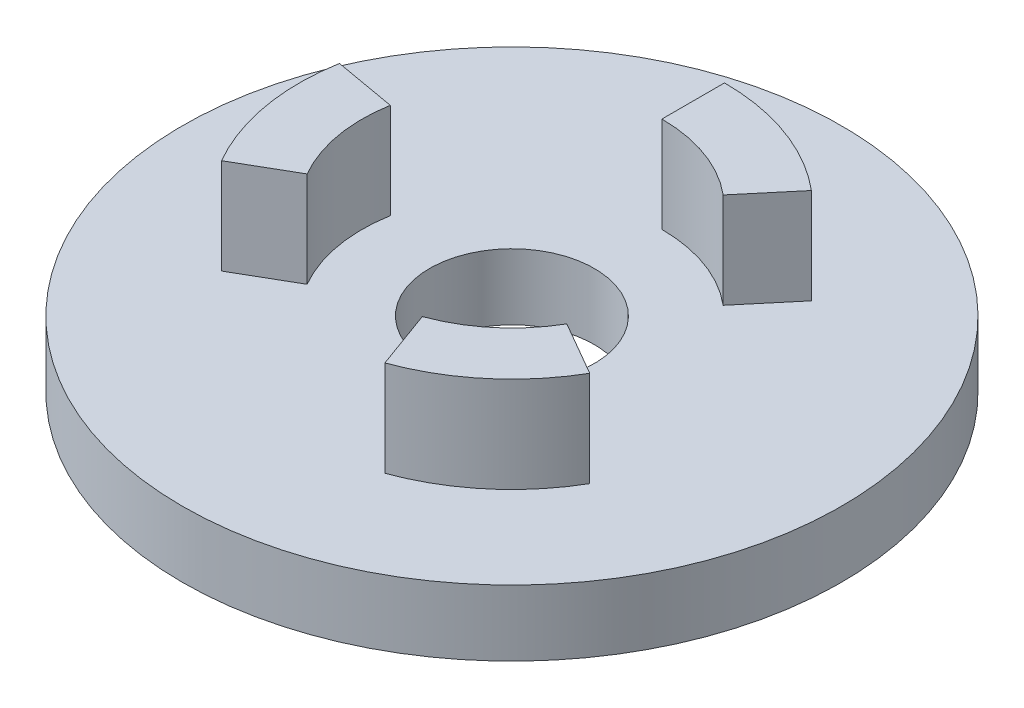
ISO-10303-21;
HEADER;
FILE_DESCRIPTION(('STEP AP214'),'2;1');
FILE_NAME('part.step','',(''),(''),'','','');
FILE_SCHEMA(('AUTOMOTIVE_DESIGN { 1 0 10303 214 1 1 1 1 }'));
ENDSEC;
DATA;
#1=APPLICATION_CONTEXT('core data for automotive mechanical design processes');
#2=APPLICATION_PROTOCOL_DEFINITION('international standard','automotive_design',2000,#1);
#3=PRODUCT_CONTEXT('',#1,'mechanical');
#4=PRODUCT('Part','Part','',(#3));
#5=PRODUCT_RELATED_PRODUCT_CATEGORY('part','',(#4));
#6=PRODUCT_DEFINITION_FORMATION('','',#4);
#7=PRODUCT_DEFINITION_CONTEXT('part definition',#1,'design');
#8=PRODUCT_DEFINITION('design','',#6,#7);
#9=PRODUCT_DEFINITION_SHAPE('','',#8);
#10=(LENGTH_UNIT() NAMED_UNIT(*) SI_UNIT(.MILLI.,.METRE.));
#11=(NAMED_UNIT(*) PLANE_ANGLE_UNIT() SI_UNIT($,.RADIAN.));
#12=(NAMED_UNIT(*) SI_UNIT($,.STERADIAN.) SOLID_ANGLE_UNIT());
#13=UNCERTAINTY_MEASURE_WITH_UNIT(LENGTH_MEASURE(1.E-05),#10,'distance_accuracy_value','');
#14=(GEOMETRIC_REPRESENTATION_CONTEXT(3) GLOBAL_UNCERTAINTY_ASSIGNED_CONTEXT((#13)) GLOBAL_UNIT_ASSIGNED_CONTEXT((#10,
#11,#12)) REPRESENTATION_CONTEXT('',''));
#15=CARTESIAN_POINT('',(0.,0.,0.));
#16=DIRECTION('',(0.,0.,1.));
#17=DIRECTION('',(1.,0.,0.));
#18=AXIS2_PLACEMENT_3D('',#15,#16,#17);
#19=CARTESIAN_POINT('',(0.,2.,0.));
#20=DIRECTION('',(0.,1.,0.));
#21=DIRECTION('',(0.,0.,1.));
#22=AXIS2_PLACEMENT_3D('',#19,#20,#21);
#23=PLANE('',#22);
#24=CARTESIAN_POINT('',(0.,2.,0.));
#25=DIRECTION('',(0.,1.,0.));
#26=DIRECTION('',(0.,0.,1.));
#27=AXIS2_PLACEMENT_3D('',#24,#25,#26);
#28=CIRCLE('',#27,2.5);
#29=CARTESIAN_POINT('',(0.,2.,2.5));
#30=VERTEX_POINT('',#29);
#31=EDGE_CURVE('E302',#30,#30,#28,.T.);
#32=ORIENTED_EDGE('',*,*,#31,.F.);
#33=EDGE_LOOP('',(#32));
#34=FACE_BOUND('',#33,.T.);
#35=CARTESIAN_POINT('',(0.,2.,0.));
#36=DIRECTION('',(0.,1.,0.));
#37=DIRECTION('',(0.866025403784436,0.,-0.500000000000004));
#38=AXIS2_PLACEMENT_3D('',#35,#36,#37);
#39=CIRCLE('',#38,6.45);
#40=CARTESIAN_POINT('',(-6.35201000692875,2.,-1.12003074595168));
#41=VERTEX_POINT('',#40);
#42=CARTESIAN_POINT('',(-5.58586385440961,2.,3.22500000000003));
#43=VERTEX_POINT('',#42);
#44=EDGE_CURVE('E151',#41,#43,#39,.T.);
#45=ORIENTED_EDGE('',*,*,#44,.F.);
#46=DIRECTION('',(-0.984807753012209,0.,-0.173648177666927));
#47=VECTOR('',#46,1.);
#48=CARTESIAN_POINT('',(0.,2.,0.));
#49=LINE('',#48,#47);
#50=CARTESIAN_POINT('',(-4.48087527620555,2.,-0.790099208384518));
#51=VERTEX_POINT('',#50);
#52=EDGE_CURVE('E148',#51,#41,#49,.T.);
#53=ORIENTED_EDGE('',*,*,#52,.F.);
#54=CARTESIAN_POINT('',(0.,2.,0.));
#55=DIRECTION('',(0.,1.,0.));
#56=DIRECTION('',(0.866025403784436,0.,-0.500000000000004));
#57=AXIS2_PLACEMENT_3D('',#54,#55,#56);
#58=CIRCLE('',#57,4.55);
#59=CARTESIAN_POINT('',(-3.94041558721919,2.,2.27500000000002));
#60=VERTEX_POINT('',#59);
#61=EDGE_CURVE('E161',#51,#60,#58,.T.);
#62=ORIENTED_EDGE('',*,*,#61,.T.);
#63=DIRECTION('',(-0.866025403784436,0.,0.500000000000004));
#64=VECTOR('',#63,1.);
#65=CARTESIAN_POINT('',(0.,2.,0.));
#66=LINE('',#65,#64);
#67=EDGE_CURVE('E172',#60,#43,#66,.T.);
#68=ORIENTED_EDGE('',*,*,#67,.T.);
#69=EDGE_LOOP('',(#45,#53,#62,#68));
#70=FACE_BOUND('',#69,.T.);
#71=CARTESIAN_POINT('',(0.,2.,0.));
#72=DIRECTION('',(0.,1.,0.));
#73=DIRECTION('',(0.,0.,1.));
#74=AXIS2_PLACEMENT_3D('',#71,#72,#73);
#75=CIRCLE('',#74,10.);
#76=CARTESIAN_POINT('',(0.,2.,10.));
#77=VERTEX_POINT('',#76);
#78=EDGE_CURVE('E11',#77,#77,#75,.T.);
#79=ORIENTED_EDGE('',*,*,#78,.T.);
#80=EDGE_LOOP('',(#79));
#81=FACE_BOUND('',#80,.T.);
#82=CARTESIAN_POINT('',(0.,2.,0.));
#83=DIRECTION('',(0.,1.,0.));
#84=DIRECTION('',(0.,0.,1.));
#85=AXIS2_PLACEMENT_3D('',#82,#83,#84);
#86=CIRCLE('',#85,6.45);
#87=CARTESIAN_POINT('',(4.14598008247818,2.,-4.9409866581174));
#88=VERTEX_POINT('',#87);
#89=CARTESIAN_POINT('',(0.,2.,-6.45));
#90=VERTEX_POINT('',#89);
#91=EDGE_CURVE('E202',#88,#90,#86,.T.);
#92=ORIENTED_EDGE('',*,*,#91,.F.);
#93=DIRECTION('',(0.642787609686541,0.,-0.766044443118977));
#94=VECTOR('',#93,1.);
#95=CARTESIAN_POINT('',(0.,2.,0.));
#96=LINE('',#95,#94);
#97=CARTESIAN_POINT('',(2.92468362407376,2.,-3.48550221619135));
#98=VERTEX_POINT('',#97);
#99=EDGE_CURVE('E186',#98,#88,#96,.T.);
#100=ORIENTED_EDGE('',*,*,#99,.F.);
#101=CARTESIAN_POINT('',(0.,2.,0.));
#102=DIRECTION('',(0.,1.,0.));
#103=DIRECTION('',(0.,0.,1.));
#104=AXIS2_PLACEMENT_3D('',#101,#102,#103);
#105=CIRCLE('',#104,4.55);
#106=CARTESIAN_POINT('',(0.,2.,-4.55));
#107=VERTEX_POINT('',#106);
#108=EDGE_CURVE('E191',#98,#107,#105,.T.);
#109=ORIENTED_EDGE('',*,*,#108,.T.);
#110=DIRECTION('',(0.,0.,-1.));
#111=VECTOR('',#110,1.);
#112=CARTESIAN_POINT('',(0.,2.,0.));
#113=LINE('',#112,#111);
#114=EDGE_CURVE('E205',#107,#90,#113,.T.);
#115=ORIENTED_EDGE('',*,*,#114,.T.);
#116=EDGE_LOOP('',(#92,#100,#109,#115));
#117=FACE_BOUND('',#116,.T.);
#118=CARTESIAN_POINT('',(0.,2.,0.));
#119=DIRECTION('',(0.,1.,0.));
#120=DIRECTION('',(-0.866025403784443,0.,-0.499999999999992));
#121=AXIS2_PLACEMENT_3D('',#118,#119,#120);
#122=CIRCLE('',#121,6.45);
#123=CARTESIAN_POINT('',(2.20602992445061,2.,6.06101740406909));
#124=VERTEX_POINT('',#123);
#125=CARTESIAN_POINT('',(5.58586385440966,2.,3.22499999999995));
#126=VERTEX_POINT('',#125);
#127=EDGE_CURVE('E52',#124,#126,#122,.T.);
#128=ORIENTED_EDGE('',*,*,#127,.F.);
#129=DIRECTION('',(0.342020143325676,0.,0.939692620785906));
#130=VECTOR('',#129,1.);
#131=CARTESIAN_POINT('',(0.,2.,0.));
#132=LINE('',#131,#130);
#133=CARTESIAN_POINT('',(1.55619165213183,2.,4.27560142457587));
#134=VERTEX_POINT('',#133);
#135=EDGE_CURVE('E147',#134,#124,#132,.T.);
#136=ORIENTED_EDGE('',*,*,#135,.F.);
#137=CARTESIAN_POINT('',(0.,2.,0.));
#138=DIRECTION('',(0.,1.,0.));
#139=DIRECTION('',(-0.866025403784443,0.,-0.499999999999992));
#140=AXIS2_PLACEMENT_3D('',#137,#138,#139);
#141=CIRCLE('',#140,4.55);
#142=CARTESIAN_POINT('',(3.94041558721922,2.,2.27499999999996));
#143=VERTEX_POINT('',#142);
#144=EDGE_CURVE('E144',#134,#143,#141,.T.);
#145=ORIENTED_EDGE('',*,*,#144,.T.);
#146=DIRECTION('',(0.866025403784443,0.,0.499999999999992));
#147=VECTOR('',#146,1.);
#148=CARTESIAN_POINT('',(0.,2.,0.));
#149=LINE('',#148,#147);
#150=EDGE_CURVE('E57',#143,#126,#149,.T.);
#151=ORIENTED_EDGE('',*,*,#150,.T.);
#152=EDGE_LOOP('',(#128,#136,#145,#151));
#153=FACE_BOUND('',#152,.T.);
#154=ADVANCED_FACE('F37',(#34,#70,#81,#117,#153),#23,.T.);
#155=CARTESIAN_POINT('',(0.,2.,0.));
#156=DIRECTION('',(0.,-1.,0.));
#157=DIRECTION('',(0.,0.,-1.));
#158=AXIS2_PLACEMENT_3D('',#155,#156,#157);
#159=CYLINDRICAL_SURFACE('',#158,10.);
#160=ORIENTED_EDGE('',*,*,#78,.F.);
#161=EDGE_LOOP('',(#160));
#162=FACE_BOUND('',#161,.T.);
#163=CARTESIAN_POINT('',(0.,0.,0.));
#164=DIRECTION('',(0.,1.,0.));
#165=DIRECTION('',(0.,0.,1.));
#166=AXIS2_PLACEMENT_3D('',#163,#164,#165);
#167=CIRCLE('',#166,10.);
#168=CARTESIAN_POINT('',(0.,0.,10.));
#169=VERTEX_POINT('',#168);
#170=EDGE_CURVE('E41',#169,#169,#167,.T.);
#171=ORIENTED_EDGE('',*,*,#170,.T.);
#172=EDGE_LOOP('',(#171));
#173=FACE_BOUND('',#172,.T.);
#174=ADVANCED_FACE('F39',(#162,#173),#159,.T.);
#175=CARTESIAN_POINT('',(0.,0.,0.));
#176=DIRECTION('',(0.,1.,0.));
#177=DIRECTION('',(0.,0.,1.));
#178=AXIS2_PLACEMENT_3D('',#175,#176,#177);
#179=PLANE('',#178);
#180=CARTESIAN_POINT('',(0.,0.,0.));
#181=DIRECTION('',(0.,1.,0.));
#182=DIRECTION('',(0.,0.,1.));
#183=AXIS2_PLACEMENT_3D('',#180,#181,#182);
#184=CIRCLE('',#183,2.5);
#185=CARTESIAN_POINT('',(0.,0.,2.5));
#186=VERTEX_POINT('',#185);
#187=EDGE_CURVE('E300',#186,#186,#184,.T.);
#188=ORIENTED_EDGE('',*,*,#187,.T.);
#189=EDGE_LOOP('',(#188));
#190=FACE_BOUND('',#189,.T.);
#191=ORIENTED_EDGE('',*,*,#170,.F.);
#192=EDGE_LOOP('',(#191));
#193=FACE_BOUND('',#192,.T.);
#194=ADVANCED_FACE('F224',(#190,#193),#179,.F.);
#195=CARTESIAN_POINT('',(0.,4.9,0.));
#196=DIRECTION('',(-0.766044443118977,0.,-0.64278760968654));
#197=DIRECTION('',(-0.642787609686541,0.,0.766044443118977));
#198=AXIS2_PLACEMENT_3D('',#195,#196,#197);
#199=PLANE('',#198);
#200=ORIENTED_EDGE('',*,*,#99,.T.);
#201=DIRECTION('',(0.,-1.,0.));
#202=VECTOR('',#201,1.);
#203=CARTESIAN_POINT('',(4.14598008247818,4.9,-4.9409866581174));
#204=LINE('',#203,#202);
#205=CARTESIAN_POINT('',(4.14598008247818,4.9,-4.9409866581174));
#206=VERTEX_POINT('',#205);
#207=EDGE_CURVE('E216',#206,#88,#204,.T.);
#208=ORIENTED_EDGE('',*,*,#207,.F.);
#209=DIRECTION('',(0.642787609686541,0.,-0.766044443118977));
#210=VECTOR('',#209,1.);
#211=CARTESIAN_POINT('',(0.,4.9,0.));
#212=LINE('',#211,#210);
#213=CARTESIAN_POINT('',(2.92468362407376,4.9,-3.48550221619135));
#214=VERTEX_POINT('',#213);
#215=EDGE_CURVE('E187',#214,#206,#212,.T.);
#216=ORIENTED_EDGE('',*,*,#215,.F.);
#217=DIRECTION('',(0.,-1.,0.));
#218=VECTOR('',#217,1.);
#219=CARTESIAN_POINT('',(2.92468362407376,4.9,-3.48550221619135));
#220=LINE('',#219,#218);
#221=EDGE_CURVE('E199',#214,#98,#220,.T.);
#222=ORIENTED_EDGE('',*,*,#221,.T.);
#223=EDGE_LOOP('',(#200,#208,#216,#222));
#224=FACE_BOUND('',#223,.T.);
#225=ADVANCED_FACE('F226',(#224),#199,.F.);
#226=CARTESIAN_POINT('',(0.,4.9,0.));
#227=DIRECTION('',(0.,-1.,0.));
#228=DIRECTION('',(0.,0.,-1.));
#229=AXIS2_PLACEMENT_3D('',#226,#227,#228);
#230=CYLINDRICAL_SURFACE('',#229,6.45);
#231=ORIENTED_EDGE('',*,*,#91,.T.);
#232=DIRECTION('',(0.,-1.,0.));
#233=VECTOR('',#232,1.);
#234=CARTESIAN_POINT('',(0.,4.9,-6.45));
#235=LINE('',#234,#233);
#236=CARTESIAN_POINT('',(0.,4.9,-6.45));
#237=VERTEX_POINT('',#236);
#238=EDGE_CURVE('E213',#237,#90,#235,.T.);
#239=ORIENTED_EDGE('',*,*,#238,.F.);
#240=CARTESIAN_POINT('',(0.,4.9,0.));
#241=DIRECTION('',(0.,1.,0.));
#242=DIRECTION('',(0.,0.,1.));
#243=AXIS2_PLACEMENT_3D('',#240,#241,#242);
#244=CIRCLE('',#243,6.45);
#245=EDGE_CURVE('E190',#206,#237,#244,.T.);
#246=ORIENTED_EDGE('',*,*,#245,.F.);
#247=ORIENTED_EDGE('',*,*,#207,.T.);
#248=EDGE_LOOP('',(#231,#239,#246,#247));
#249=FACE_BOUND('',#248,.T.);
#250=ADVANCED_FACE('F232',(#249),#230,.T.);
#251=CARTESIAN_POINT('',(0.,4.9,0.));
#252=DIRECTION('',(-1.,0.,0.));
#253=DIRECTION('',(0.,0.,1.));
#254=AXIS2_PLACEMENT_3D('',#251,#252,#253);
#255=PLANE('',#254);
#256=ORIENTED_EDGE('',*,*,#114,.F.);
#257=DIRECTION('',(0.,-1.,0.));
#258=VECTOR('',#257,1.);
#259=CARTESIAN_POINT('',(0.,4.9,-4.55));
#260=LINE('',#259,#258);
#261=CARTESIAN_POINT('',(0.,4.9,-4.55));
#262=VERTEX_POINT('',#261);
#263=EDGE_CURVE('E210',#262,#107,#260,.T.);
#264=ORIENTED_EDGE('',*,*,#263,.F.);
#265=DIRECTION('',(0.,0.,-1.));
#266=VECTOR('',#265,1.);
#267=CARTESIAN_POINT('',(0.,4.9,0.));
#268=LINE('',#267,#266);
#269=EDGE_CURVE('E193',#262,#237,#268,.T.);
#270=ORIENTED_EDGE('',*,*,#269,.T.);
#271=ORIENTED_EDGE('',*,*,#238,.T.);
#272=EDGE_LOOP('',(#256,#264,#270,#271));
#273=FACE_BOUND('',#272,.T.);
#274=ADVANCED_FACE('F247',(#273),#255,.T.);
#275=CARTESIAN_POINT('',(0.,4.9,0.));
#276=DIRECTION('',(0.,-1.,0.));
#277=DIRECTION('',(0.,0.,-1.));
#278=AXIS2_PLACEMENT_3D('',#275,#276,#277);
#279=CYLINDRICAL_SURFACE('',#278,4.55);
#280=ORIENTED_EDGE('',*,*,#108,.F.);
#281=ORIENTED_EDGE('',*,*,#221,.F.);
#282=CARTESIAN_POINT('',(0.,4.9,0.));
#283=DIRECTION('',(0.,1.,0.));
#284=DIRECTION('',(0.,0.,1.));
#285=AXIS2_PLACEMENT_3D('',#282,#283,#284);
#286=CIRCLE('',#285,4.55);
#287=EDGE_CURVE('E196',#214,#262,#286,.T.);
#288=ORIENTED_EDGE('',*,*,#287,.T.);
#289=ORIENTED_EDGE('',*,*,#263,.T.);
#290=EDGE_LOOP('',(#280,#281,#288,#289));
#291=FACE_BOUND('',#290,.T.);
#292=ADVANCED_FACE('F250',(#291),#279,.F.);
#293=CARTESIAN_POINT('',(0.,4.9,0.));
#294=DIRECTION('',(0.,1.,0.));
#295=DIRECTION('',(0.,0.,1.));
#296=AXIS2_PLACEMENT_3D('',#293,#294,#295);
#297=PLANE('',#296);
#298=ORIENTED_EDGE('',*,*,#215,.T.);
#299=ORIENTED_EDGE('',*,*,#245,.T.);
#300=ORIENTED_EDGE('',*,*,#269,.F.);
#301=ORIENTED_EDGE('',*,*,#287,.F.);
#302=EDGE_LOOP('',(#298,#299,#300,#301));
#303=FACE_BOUND('',#302,.T.);
#304=ADVANCED_FACE('F254',(#303),#297,.T.);
#305=CARTESIAN_POINT('',(0.,4.9,0.));
#306=DIRECTION('',(-0.173648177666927,0.,0.984807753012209));
#307=DIRECTION('',(0.984807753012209,0.,0.173648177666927));
#308=AXIS2_PLACEMENT_3D('',#305,#306,#307);
#309=PLANE('',#308);
#310=ORIENTED_EDGE('',*,*,#52,.T.);
#311=DIRECTION('',(0.,-1.,0.));
#312=VECTOR('',#311,1.);
#313=CARTESIAN_POINT('',(-6.35201000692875,4.9,-1.12003074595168));
#314=LINE('',#313,#312);
#315=CARTESIAN_POINT('',(-6.35201000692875,4.9,-1.12003074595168));
#316=VERTEX_POINT('',#315);
#317=EDGE_CURVE('E183',#316,#41,#314,.T.);
#318=ORIENTED_EDGE('',*,*,#317,.F.);
#319=DIRECTION('',(-0.984807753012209,0.,-0.173648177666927));
#320=VECTOR('',#319,1.);
#321=CARTESIAN_POINT('',(0.,4.9,0.));
#322=LINE('',#321,#320);
#323=CARTESIAN_POINT('',(-4.48087527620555,4.9,-0.790099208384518));
#324=VERTEX_POINT('',#323);
#325=EDGE_CURVE('E157',#324,#316,#322,.T.);
#326=ORIENTED_EDGE('',*,*,#325,.F.);
#327=DIRECTION('',(0.,-1.,0.));
#328=VECTOR('',#327,1.);
#329=CARTESIAN_POINT('',(-4.48087527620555,4.9,-0.790099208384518));
#330=LINE('',#329,#328);
#331=EDGE_CURVE('E168',#324,#51,#330,.T.);
#332=ORIENTED_EDGE('',*,*,#331,.T.);
#333=EDGE_LOOP('',(#310,#318,#326,#332));
#334=FACE_BOUND('',#333,.T.);
#335=ADVANCED_FACE('F258',(#334),#309,.F.);
#336=CARTESIAN_POINT('',(0.,4.9,0.));
#337=DIRECTION('',(0.,-1.,0.));
#338=DIRECTION('',(0.,0.,-1.));
#339=AXIS2_PLACEMENT_3D('',#336,#337,#338);
#340=CYLINDRICAL_SURFACE('',#339,6.45);
#341=ORIENTED_EDGE('',*,*,#44,.T.);
#342=DIRECTION('',(0.,-1.,0.));
#343=VECTOR('',#342,1.);
#344=CARTESIAN_POINT('',(-5.58586385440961,4.9,3.22500000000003));
#345=LINE('',#344,#343);
#346=CARTESIAN_POINT('',(-5.58586385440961,4.9,3.22500000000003));
#347=VERTEX_POINT('',#346);
#348=EDGE_CURVE('E180',#347,#43,#345,.T.);
#349=ORIENTED_EDGE('',*,*,#348,.F.);
#350=CARTESIAN_POINT('',(0.,4.9,0.));
#351=DIRECTION('',(0.,1.,0.));
#352=DIRECTION('',(0.866025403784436,0.,-0.500000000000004));
#353=AXIS2_PLACEMENT_3D('',#350,#351,#352);
#354=CIRCLE('',#353,6.45);
#355=EDGE_CURVE('E160',#316,#347,#354,.T.);
#356=ORIENTED_EDGE('',*,*,#355,.F.);
#357=ORIENTED_EDGE('',*,*,#317,.T.);
#358=EDGE_LOOP('',(#341,#349,#356,#357));
#359=FACE_BOUND('',#358,.T.);
#360=ADVANCED_FACE('F262',(#359),#340,.T.);
#361=CARTESIAN_POINT('',(0.,4.9,0.));
#362=DIRECTION('',(0.500000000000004,0.,0.866025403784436));
#363=DIRECTION('',(0.866025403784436,0.,-0.500000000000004));
#364=AXIS2_PLACEMENT_3D('',#361,#362,#363);
#365=PLANE('',#364);
#366=ORIENTED_EDGE('',*,*,#67,.F.);
#367=DIRECTION('',(0.,-1.,0.));
#368=VECTOR('',#367,1.);
#369=CARTESIAN_POINT('',(-3.94041558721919,4.9,2.27500000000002));
#370=LINE('',#369,#368);
#371=CARTESIAN_POINT('',(-3.94041558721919,4.9,2.27500000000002));
#372=VERTEX_POINT('',#371);
#373=EDGE_CURVE('E177',#372,#60,#370,.T.);
#374=ORIENTED_EDGE('',*,*,#373,.F.);
#375=DIRECTION('',(-0.866025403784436,0.,0.500000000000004));
#376=VECTOR('',#375,1.);
#377=CARTESIAN_POINT('',(0.,4.9,0.));
#378=LINE('',#377,#376);
#379=EDGE_CURVE('E163',#372,#347,#378,.T.);
#380=ORIENTED_EDGE('',*,*,#379,.T.);
#381=ORIENTED_EDGE('',*,*,#348,.T.);
#382=EDGE_LOOP('',(#366,#374,#380,#381));
#383=FACE_BOUND('',#382,.T.);
#384=ADVANCED_FACE('F266',(#383),#365,.T.);
#385=CARTESIAN_POINT('',(0.,4.9,0.));
#386=DIRECTION('',(0.,-1.,0.));
#387=DIRECTION('',(0.,0.,-1.));
#388=AXIS2_PLACEMENT_3D('',#385,#386,#387);
#389=CYLINDRICAL_SURFACE('',#388,4.55);
#390=ORIENTED_EDGE('',*,*,#61,.F.);
#391=ORIENTED_EDGE('',*,*,#331,.F.);
#392=CARTESIAN_POINT('',(0.,4.9,0.));
#393=DIRECTION('',(0.,1.,0.));
#394=DIRECTION('',(0.866025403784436,0.,-0.500000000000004));
#395=AXIS2_PLACEMENT_3D('',#392,#393,#394);
#396=CIRCLE('',#395,4.55);
#397=EDGE_CURVE('E166',#324,#372,#396,.T.);
#398=ORIENTED_EDGE('',*,*,#397,.T.);
#399=ORIENTED_EDGE('',*,*,#373,.T.);
#400=EDGE_LOOP('',(#390,#391,#398,#399));
#401=FACE_BOUND('',#400,.T.);
#402=ADVANCED_FACE('F270',(#401),#389,.F.);
#403=CARTESIAN_POINT('',(0.,4.9,0.));
#404=DIRECTION('',(0.,1.,0.));
#405=DIRECTION('',(0.866025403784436,0.,-0.500000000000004));
#406=AXIS2_PLACEMENT_3D('',#403,#404,#405);
#407=PLANE('',#406);
#408=ORIENTED_EDGE('',*,*,#325,.T.);
#409=ORIENTED_EDGE('',*,*,#355,.T.);
#410=ORIENTED_EDGE('',*,*,#379,.F.);
#411=ORIENTED_EDGE('',*,*,#397,.F.);
#412=EDGE_LOOP('',(#408,#409,#410,#411));
#413=FACE_BOUND('',#412,.T.);
#414=ADVANCED_FACE('F274',(#413),#407,.T.);
#415=CARTESIAN_POINT('',(0.,4.9,0.));
#416=DIRECTION('',(0.939692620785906,0.,-0.342020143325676));
#417=DIRECTION('',(-0.342020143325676,0.,-0.939692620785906));
#418=AXIS2_PLACEMENT_3D('',#415,#416,#417);
#419=PLANE('',#418);
#420=ORIENTED_EDGE('',*,*,#135,.T.);
#421=DIRECTION('',(0.,-1.,0.));
#422=VECTOR('',#421,1.);
#423=CARTESIAN_POINT('',(2.20602992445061,4.9,6.06101740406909));
#424=LINE('',#423,#422);
#425=CARTESIAN_POINT('',(2.20602992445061,4.9,6.06101740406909));
#426=VERTEX_POINT('',#425);
#427=EDGE_CURVE('E128',#426,#124,#424,.T.);
#428=ORIENTED_EDGE('',*,*,#427,.F.);
#429=DIRECTION('',(0.342020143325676,0.,0.939692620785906));
#430=VECTOR('',#429,1.);
#431=CARTESIAN_POINT('',(0.,4.9,0.));
#432=LINE('',#431,#430);
#433=CARTESIAN_POINT('',(1.55619165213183,4.9,4.27560142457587));
#434=VERTEX_POINT('',#433);
#435=EDGE_CURVE('E135',#434,#426,#432,.T.);
#436=ORIENTED_EDGE('',*,*,#435,.F.);
#437=DIRECTION('',(0.,-1.,0.));
#438=VECTOR('',#437,1.);
#439=CARTESIAN_POINT('',(1.55619165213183,4.9,4.27560142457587));
#440=LINE('',#439,#438);
#441=EDGE_CURVE('E308',#434,#134,#440,.T.);
#442=ORIENTED_EDGE('',*,*,#441,.T.);
#443=EDGE_LOOP('',(#420,#428,#436,#442));
#444=FACE_BOUND('',#443,.T.);
#445=ADVANCED_FACE('F146',(#444),#419,.F.);
#446=CARTESIAN_POINT('',(0.,4.9,0.));
#447=DIRECTION('',(0.,-1.,0.));
#448=DIRECTION('',(0.,0.,-1.));
#449=AXIS2_PLACEMENT_3D('',#446,#447,#448);
#450=CYLINDRICAL_SURFACE('',#449,6.45);
#451=ORIENTED_EDGE('',*,*,#127,.T.);
#452=DIRECTION('',(0.,-1.,0.));
#453=VECTOR('',#452,1.);
#454=CARTESIAN_POINT('',(5.58586385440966,4.9,3.22499999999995));
#455=LINE('',#454,#453);
#456=CARTESIAN_POINT('',(5.58586385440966,4.9,3.22499999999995));
#457=VERTEX_POINT('',#456);
#458=EDGE_CURVE('E130',#457,#126,#455,.T.);
#459=ORIENTED_EDGE('',*,*,#458,.F.);
#460=CARTESIAN_POINT('',(0.,4.9,0.));
#461=DIRECTION('',(0.,1.,0.));
#462=DIRECTION('',(-0.866025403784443,0.,-0.499999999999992));
#463=AXIS2_PLACEMENT_3D('',#460,#461,#462);
#464=CIRCLE('',#463,6.45);
#465=EDGE_CURVE('E124',#426,#457,#464,.T.);
#466=ORIENTED_EDGE('',*,*,#465,.F.);
#467=ORIENTED_EDGE('',*,*,#427,.T.);
#468=EDGE_LOOP('',(#451,#459,#466,#467));
#469=FACE_BOUND('',#468,.T.);
#470=ADVANCED_FACE('F126',(#469),#450,.T.);
#471=CARTESIAN_POINT('',(0.,4.9,0.));
#472=DIRECTION('',(0.499999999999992,0.,-0.866025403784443));
#473=DIRECTION('',(-0.866025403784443,0.,-0.499999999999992));
#474=AXIS2_PLACEMENT_3D('',#471,#472,#473);
#475=PLANE('',#474);
#476=ORIENTED_EDGE('',*,*,#150,.F.);
#477=DIRECTION('',(0.,-1.,0.));
#478=VECTOR('',#477,1.);
#479=CARTESIAN_POINT('',(3.94041558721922,4.9,2.27499999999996));
#480=LINE('',#479,#478);
#481=CARTESIAN_POINT('',(3.94041558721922,4.9,2.27499999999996));
#482=VERTEX_POINT('',#481);
#483=EDGE_CURVE('E153',#482,#143,#480,.T.);
#484=ORIENTED_EDGE('',*,*,#483,.F.);
#485=DIRECTION('',(0.866025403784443,0.,0.499999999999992));
#486=VECTOR('',#485,1.);
#487=CARTESIAN_POINT('',(0.,4.9,0.));
#488=LINE('',#487,#486);
#489=EDGE_CURVE('E134',#482,#457,#488,.T.);
#490=ORIENTED_EDGE('',*,*,#489,.T.);
#491=ORIENTED_EDGE('',*,*,#458,.T.);
#492=EDGE_LOOP('',(#476,#484,#490,#491));
#493=FACE_BOUND('',#492,.T.);
#494=ADVANCED_FACE('F283',(#493),#475,.T.);
#495=CARTESIAN_POINT('',(0.,4.9,0.));
#496=DIRECTION('',(0.,-1.,0.));
#497=DIRECTION('',(0.,0.,-1.));
#498=AXIS2_PLACEMENT_3D('',#495,#496,#497);
#499=CYLINDRICAL_SURFACE('',#498,4.55);
#500=ORIENTED_EDGE('',*,*,#144,.F.);
#501=ORIENTED_EDGE('',*,*,#441,.F.);
#502=CARTESIAN_POINT('',(0.,4.9,0.));
#503=DIRECTION('',(0.,1.,0.));
#504=DIRECTION('',(-0.866025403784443,0.,-0.499999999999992));
#505=AXIS2_PLACEMENT_3D('',#502,#503,#504);
#506=CIRCLE('',#505,4.55);
#507=EDGE_CURVE('E141',#434,#482,#506,.T.);
#508=ORIENTED_EDGE('',*,*,#507,.T.);
#509=ORIENTED_EDGE('',*,*,#483,.T.);
#510=EDGE_LOOP('',(#500,#501,#508,#509));
#511=FACE_BOUND('',#510,.T.);
#512=ADVANCED_FACE('F286',(#511),#499,.F.);
#513=CARTESIAN_POINT('',(0.,4.9,0.));
#514=DIRECTION('',(0.,1.,0.));
#515=DIRECTION('',(-0.866025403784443,0.,-0.499999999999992));
#516=AXIS2_PLACEMENT_3D('',#513,#514,#515);
#517=PLANE('',#516);
#518=ORIENTED_EDGE('',*,*,#435,.T.);
#519=ORIENTED_EDGE('',*,*,#465,.T.);
#520=ORIENTED_EDGE('',*,*,#489,.F.);
#521=ORIENTED_EDGE('',*,*,#507,.F.);
#522=EDGE_LOOP('',(#518,#519,#520,#521));
#523=FACE_BOUND('',#522,.T.);
#524=ADVANCED_FACE('F139',(#523),#517,.T.);
#525=CARTESIAN_POINT('',(0.,0.,0.));
#526=DIRECTION('',(0.,1.,0.));
#527=DIRECTION('',(0.,0.,1.));
#528=AXIS2_PLACEMENT_3D('',#525,#526,#527);
#529=CYLINDRICAL_SURFACE('',#528,2.5);
#530=ORIENTED_EDGE('',*,*,#187,.F.);
#531=EDGE_LOOP('',(#530));
#532=FACE_BOUND('',#531,.T.);
#533=ORIENTED_EDGE('',*,*,#31,.T.);
#534=EDGE_LOOP('',(#533));
#535=FACE_BOUND('',#534,.T.);
#536=ADVANCED_FACE('F293',(#532,#535),#529,.F.);
#537=CLOSED_SHELL('',(#154,#174,#194,#225,#250,#274,#292,#304,#335,#360,#384,#402,#414,#445,
#470,#494,#512,#524,#536));
#538=MANIFOLD_SOLID_BREP('B2',#537);
#539=ADVANCED_BREP_SHAPE_REPRESENTATION('',(#18,#538),#14);
#540=SHAPE_DEFINITION_REPRESENTATION(#9,#539);
ENDSEC;
END-ISO-10303-21;
